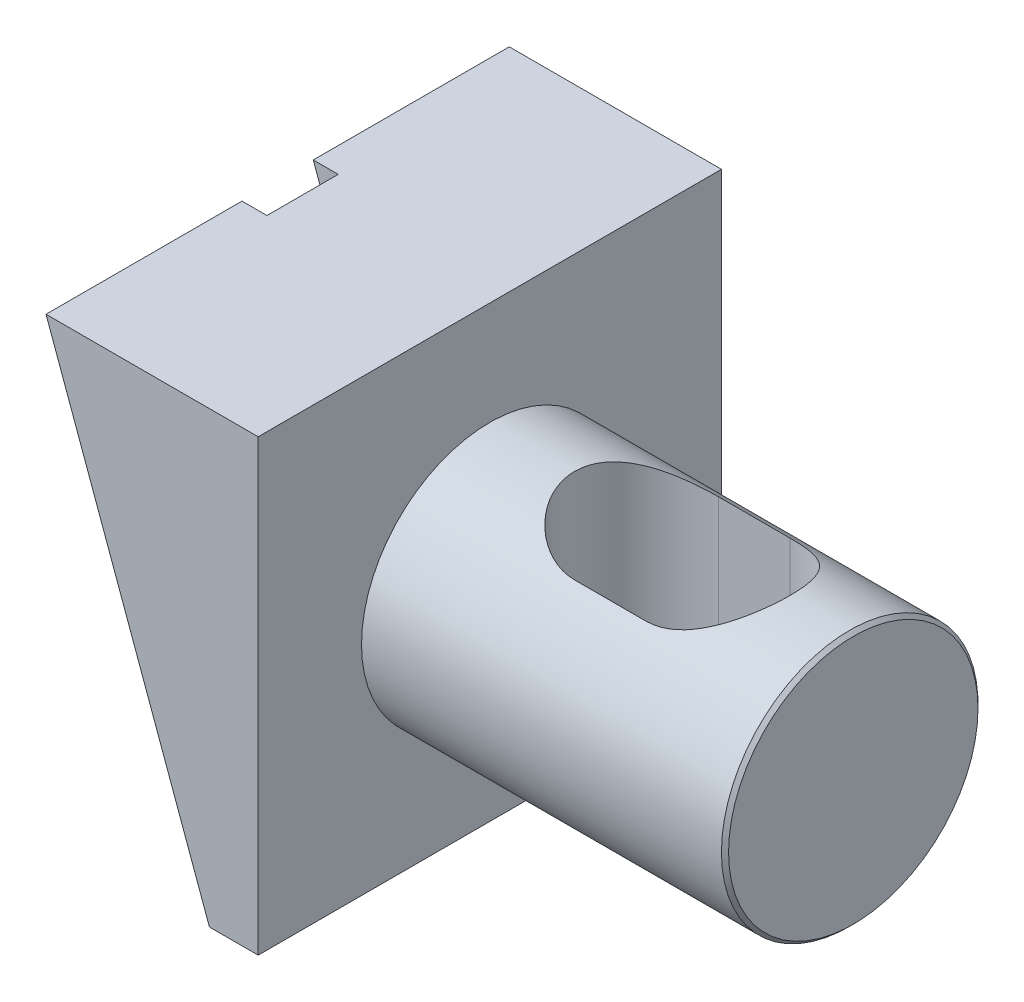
from build123d import *

# Parameters (mm, degrees)
EXTRUDE1_DEPTH          = 32.5
EXTRUDE1_DEPTH_BACK     = 32.5
CUT_EXTRUDE1_DEPTH      = 65
CUT_EXTRUDE2_DEPTH      = 5
CUT_EXTRUDE2_DEPTH_BACK = 5
SKETCH5_W               = 25
SKETCH5_H               = 13
SKETCH6_W               = 25
SKETCH6_H               = 10
CUT_EXTRUDE3_DEPTH      = 3


with BuildPart() as part:
    # Sketch1 → Revolve1 (revolve)
    with BuildSketch(Plane.XY, mode=Mode.PRIVATE) as revolve1_sk:
        Polygon((-51, 30.5), (-51, 48.5), (-0.5, 48.5), (0, 48), (0, 30.5), align=None)
    revolve(revolve1_sk.sketch.rotate(Axis((0, 30.5, 0), (-1, 0, 0)), 270), axis=Axis((0, 30.5, 0), (-1, 0, 0)))

    # Sketch2 → Extrude1 (add, two sides: drawn at the far end of the back side and taken through both)
    with BuildSketch(Plane.XY.offset(-EXTRUDE1_DEPTH_BACK)):
        Polygon((-80.772059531, 63), (-57.841934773, 0), (-51, 0), (-51, 63), align=None)
    extrude(amount=EXTRUDE1_DEPTH + EXTRUDE1_DEPTH_BACK)

    # Sketch3 → Cut-Extrude1 (cut)
    with BuildSketch(Plane(origin=(0, 0, 0), x_dir=(-1, 0, 0), z_dir=(0, 1, 0))):
        with BuildLine():
            Line((29, 10.1), (19, 10.1))
            ThreePointArc((19, 10.1), (8.9, 0), (19, -10.1))
            Line((19, -10.1), (29, -10.1))
            ThreePointArc((29, -10.1), (39.1, 0), (29, 10.1))
        make_face()
    extrude(amount=CUT_EXTRUDE1_DEPTH, mode=Mode.SUBTRACT)

    # Sketch4 → Cut-Extrude2 (cut, two sides: drawn at the far end of the back side and taken through both)
    with BuildSketch(Plane.XY.offset(-CUT_EXTRUDE2_DEPTH_BACK)):
        Polygon((-92, 0), (-54.341934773, 0), (-77.272059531, 63), (-92, 63), align=None)
    extrude(amount=CUT_EXTRUDE2_DEPTH + CUT_EXTRUDE2_DEPTH_BACK, mode=Mode.SUBTRACT)

    # Sketch5 → Cut-Revolve1 (revolve, cut)
    with BuildSketch(Plane.XY, mode=Mode.PRIVATE) as cut_revolve1_sk:
        with Locations((-67.7, 37)):
            Rectangle(SKETCH5_W, SKETCH5_H)
    revolve(cut_revolve1_sk.sketch.rotate(Axis((-55.2, 30.5, 0), (-1, 0, 0)), 270), axis=Axis((-55.2, 30.5, 0), (-1, 0, 0)), mode=Mode.SUBTRACT)

    # Sketch6 → Revolve2 (revolve)
    with BuildSketch(Plane.XY, mode=Mode.PRIVATE) as revolve2_sk:
        with Locations((-67.7, 35.5)):
            Rectangle(SKETCH6_W, SKETCH6_H)
    revolve(revolve2_sk.sketch.rotate(Axis((-55.2, 30.5, 0), (-1, 0, 0)), 270), axis=Axis((-55.2, 30.5, 0), (-1, 0, 0)))

    # Sketch7 → Revolve3 (revolve)
    with BuildSketch(Plane.XY, mode=Mode.PRIVATE) as revolve3_sk:
        with BuildLine():
            Line((-91.8, 30.5), (-91.8, 35))
            ThreePointArc((-91.8, 35), (-91.653553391, 35.353553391), (-91.3, 35.5))
            Line((-91.3, 35.5), (-87.8, 35.5))
            Line((-87.8, 35.5), (-87.8, 33.5))
            Line((-87.8, 33.5), (-78.4135, 33.5))
            Line((-78.4135, 33.5), (-77.8, 32.8865))
            Line((-77.8, 32.8865), (-77.8, 30.5))
            Line((-77.8, 30.5), (-91.8, 30.5))
        make_face()
    revolve(revolve3_sk.sketch.rotate(Axis((-77.8, 30.5, 0), (-1, 0, 0)), 270), axis=Axis((-77.8, 30.5, 0), (-1, 0, 0)))

    # Sketch8 → Cut-Extrude3 (cut)
    with BuildSketch(Plane.ZY.offset(91.8)):
        Polygon((-1.443375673, 28), (1.443375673, 28), (2.886751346, 30.5), (1.443375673, 33), (-1.443375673, 33), (-2.886751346, 30.5), align=None)
    extrude(amount=-CUT_EXTRUDE3_DEPTH, mode=Mode.SUBTRACT)


solid = part.part
